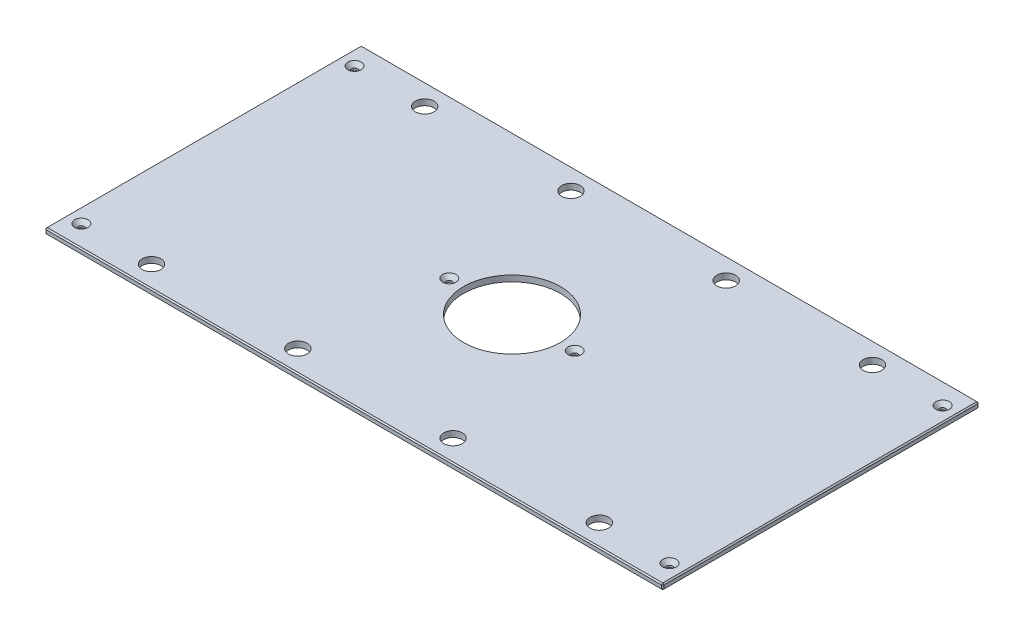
ISO-10303-21;
HEADER;
FILE_DESCRIPTION(('STEP AP214'),'2;1');
FILE_NAME('part.step','',(''),(''),'','','');
FILE_SCHEMA(('AUTOMOTIVE_DESIGN { 1 0 10303 214 1 1 1 1 }'));
ENDSEC;
DATA;
#1=APPLICATION_CONTEXT('core data for automotive mechanical design processes');
#2=APPLICATION_PROTOCOL_DEFINITION('international standard','automotive_design',2000,#1);
#3=PRODUCT_CONTEXT('',#1,'mechanical');
#4=PRODUCT('Part','Part','',(#3));
#5=PRODUCT_RELATED_PRODUCT_CATEGORY('part','',(#4));
#6=PRODUCT_DEFINITION_FORMATION('','',#4);
#7=PRODUCT_DEFINITION_CONTEXT('part definition',#1,'design');
#8=PRODUCT_DEFINITION('design','',#6,#7);
#9=PRODUCT_DEFINITION_SHAPE('','',#8);
#10=(LENGTH_UNIT() NAMED_UNIT(*) SI_UNIT(.MILLI.,.METRE.));
#11=(NAMED_UNIT(*) PLANE_ANGLE_UNIT() SI_UNIT($,.RADIAN.));
#12=(NAMED_UNIT(*) SI_UNIT($,.STERADIAN.) SOLID_ANGLE_UNIT());
#13=UNCERTAINTY_MEASURE_WITH_UNIT(LENGTH_MEASURE(1.E-05),#10,'distance_accuracy_value','');
#14=(GEOMETRIC_REPRESENTATION_CONTEXT(3) GLOBAL_UNCERTAINTY_ASSIGNED_CONTEXT((#13)) GLOBAL_UNIT_ASSIGNED_CONTEXT((#10,
#11,#12)) REPRESENTATION_CONTEXT('',''));
#15=CARTESIAN_POINT('',(0.,0.,0.));
#16=DIRECTION('',(0.,0.,1.));
#17=DIRECTION('',(1.,0.,0.));
#18=AXIS2_PLACEMENT_3D('',#15,#16,#17);
#19=CARTESIAN_POINT('',(-328.6125,6.35,-168.275));
#20=DIRECTION('',(1.,0.,0.));
#21=DIRECTION('',(0.,0.,-1.));
#22=AXIS2_PLACEMENT_3D('',#19,#20,#21);
#23=PLANE('',#22);
#24=DIRECTION('',(0.,0.,-1.));
#25=VECTOR('',#24,1.);
#26=CARTESIAN_POINT('',(-328.6125,5.08000000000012,-168.275));
#27=LINE('',#26,#25);
#28=CARTESIAN_POINT('',(-328.6125,5.08000000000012,167.005));
#29=VERTEX_POINT('',#28);
#30=CARTESIAN_POINT('',(-328.6125,5.08000000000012,-167.005));
#31=VERTEX_POINT('',#30);
#32=EDGE_CURVE('E140',#29,#31,#27,.T.);
#33=ORIENTED_EDGE('',*,*,#32,.T.);
#34=DIRECTION('',(0.,-1.,0.));
#35=VECTOR('',#34,1.);
#36=CARTESIAN_POINT('',(-328.6125,6.35,-167.005));
#37=LINE('',#36,#35);
#38=CARTESIAN_POINT('',(-328.6125,1.26999999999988,-167.005));
#39=VERTEX_POINT('',#38);
#40=EDGE_CURVE('E135',#31,#39,#37,.T.);
#41=ORIENTED_EDGE('',*,*,#40,.T.);
#42=DIRECTION('',(0.,0.,1.));
#43=VECTOR('',#42,1.);
#44=CARTESIAN_POINT('',(-328.6125,1.26999999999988,-168.275));
#45=LINE('',#44,#43);
#46=CARTESIAN_POINT('',(-328.6125,1.26999999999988,167.005));
#47=VERTEX_POINT('',#46);
#48=EDGE_CURVE('E130',#39,#47,#45,.T.);
#49=ORIENTED_EDGE('',*,*,#48,.T.);
#50=DIRECTION('',(0.,1.,0.));
#51=VECTOR('',#50,1.);
#52=CARTESIAN_POINT('',(-328.6125,6.35,167.005));
#53=LINE('',#52,#51);
#54=EDGE_CURVE('E132',#47,#29,#53,.T.);
#55=ORIENTED_EDGE('',*,*,#54,.T.);
#56=EDGE_LOOP('',(#33,#41,#49,#55));
#57=FACE_BOUND('',#56,.T.);
#58=ADVANCED_FACE('F38',(#57),#23,.F.);
#59=CARTESIAN_POINT('',(-328.6125,6.35,168.275));
#60=DIRECTION('',(0.,0.,-1.));
#61=DIRECTION('',(-1.,0.,0.));
#62=AXIS2_PLACEMENT_3D('',#59,#60,#61);
#63=PLANE('',#62);
#64=DIRECTION('',(1.,0.,0.));
#65=VECTOR('',#64,1.);
#66=CARTESIAN_POINT('',(-328.6125,1.26999999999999,168.275));
#67=LINE('',#66,#65);
#68=CARTESIAN_POINT('',(-327.3425,1.26999999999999,168.275));
#69=VERTEX_POINT('',#68);
#70=CARTESIAN_POINT('',(327.3425,1.26999999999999,168.275));
#71=VERTEX_POINT('',#70);
#72=EDGE_CURVE('E62',#69,#71,#67,.T.);
#73=ORIENTED_EDGE('',*,*,#72,.T.);
#74=DIRECTION('',(0.,1.,0.));
#75=VECTOR('',#74,1.);
#76=CARTESIAN_POINT('',(327.3425,6.35,168.275));
#77=LINE('',#76,#75);
#78=CARTESIAN_POINT('',(327.3425,5.08000000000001,168.275));
#79=VERTEX_POINT('',#78);
#80=EDGE_CURVE('E11',#71,#79,#77,.T.);
#81=ORIENTED_EDGE('',*,*,#80,.T.);
#82=DIRECTION('',(-1.,0.,0.));
#83=VECTOR('',#82,1.);
#84=CARTESIAN_POINT('',(-328.6125,5.08000000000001,168.275));
#85=LINE('',#84,#83);
#86=CARTESIAN_POINT('',(-327.3425,5.08000000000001,168.275));
#87=VERTEX_POINT('',#86);
#88=EDGE_CURVE('E48',#79,#87,#85,.T.);
#89=ORIENTED_EDGE('',*,*,#88,.T.);
#90=DIRECTION('',(0.,-1.,0.));
#91=VECTOR('',#90,1.);
#92=CARTESIAN_POINT('',(-327.3425,6.35,168.275));
#93=LINE('',#92,#91);
#94=EDGE_CURVE('E367',#87,#69,#93,.T.);
#95=ORIENTED_EDGE('',*,*,#94,.T.);
#96=EDGE_LOOP('',(#73,#81,#89,#95));
#97=FACE_BOUND('',#96,.T.);
#98=ADVANCED_FACE('F445',(#97),#63,.F.);
#99=CARTESIAN_POINT('',(328.6125,6.35,-168.275));
#100=DIRECTION('',(-1.,0.,0.));
#101=DIRECTION('',(0.,0.,1.));
#102=AXIS2_PLACEMENT_3D('',#99,#100,#101);
#103=PLANE('',#102);
#104=DIRECTION('',(0.,0.,-1.));
#105=VECTOR('',#104,1.);
#106=CARTESIAN_POINT('',(328.6125,1.26999999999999,-168.275));
#107=LINE('',#106,#105);
#108=CARTESIAN_POINT('',(328.6125,1.26999999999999,167.005));
#109=VERTEX_POINT('',#108);
#110=CARTESIAN_POINT('',(328.6125,1.26999999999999,-167.005));
#111=VERTEX_POINT('',#110);
#112=EDGE_CURVE('E360',#109,#111,#107,.T.);
#113=ORIENTED_EDGE('',*,*,#112,.T.);
#114=DIRECTION('',(0.,1.,0.));
#115=VECTOR('',#114,1.);
#116=CARTESIAN_POINT('',(328.6125,6.35,-167.005));
#117=LINE('',#116,#115);
#118=CARTESIAN_POINT('',(328.6125,5.08000000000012,-167.005));
#119=VERTEX_POINT('',#118);
#120=EDGE_CURVE('E363',#111,#119,#117,.T.);
#121=ORIENTED_EDGE('',*,*,#120,.T.);
#122=DIRECTION('',(0.,0.,1.));
#123=VECTOR('',#122,1.);
#124=CARTESIAN_POINT('',(328.6125,5.08000000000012,168.275));
#125=LINE('',#124,#123);
#126=CARTESIAN_POINT('',(328.6125,5.08000000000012,167.005));
#127=VERTEX_POINT('',#126);
#128=EDGE_CURVE('E357',#119,#127,#125,.T.);
#129=ORIENTED_EDGE('',*,*,#128,.T.);
#130=DIRECTION('',(0.,-1.,0.));
#131=VECTOR('',#130,1.);
#132=CARTESIAN_POINT('',(328.6125,6.35,167.005));
#133=LINE('',#132,#131);
#134=EDGE_CURVE('E354',#127,#109,#133,.T.);
#135=ORIENTED_EDGE('',*,*,#134,.T.);
#136=EDGE_LOOP('',(#113,#121,#129,#135));
#137=FACE_BOUND('',#136,.T.);
#138=ADVANCED_FACE('F432',(#137),#103,.F.);
#139=CARTESIAN_POINT('',(-328.6125,6.35,-168.275));
#140=DIRECTION('',(0.,0.,1.));
#141=DIRECTION('',(1.,0.,0.));
#142=AXIS2_PLACEMENT_3D('',#139,#140,#141);
#143=PLANE('',#142);
#144=DIRECTION('',(-1.,0.,0.));
#145=VECTOR('',#144,1.);
#146=CARTESIAN_POINT('',(-328.6125,1.26999999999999,-168.275));
#147=LINE('',#146,#145);
#148=CARTESIAN_POINT('',(327.3425,1.26999999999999,-168.275));
#149=VERTEX_POINT('',#148);
#150=CARTESIAN_POINT('',(-327.3425,1.26999999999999,-168.275));
#151=VERTEX_POINT('',#150);
#152=EDGE_CURVE('E320',#149,#151,#147,.T.);
#153=ORIENTED_EDGE('',*,*,#152,.T.);
#154=DIRECTION('',(0.,1.,0.));
#155=VECTOR('',#154,1.);
#156=CARTESIAN_POINT('',(-327.3425,6.35,-168.275));
#157=LINE('',#156,#155);
#158=CARTESIAN_POINT('',(-327.3425,5.08000000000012,-168.275));
#159=VERTEX_POINT('',#158);
#160=EDGE_CURVE('E326',#151,#159,#157,.T.);
#161=ORIENTED_EDGE('',*,*,#160,.T.);
#162=DIRECTION('',(1.,0.,0.));
#163=VECTOR('',#162,1.);
#164=CARTESIAN_POINT('',(328.6125,5.08000000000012,-168.275));
#165=LINE('',#164,#163);
#166=CARTESIAN_POINT('',(327.3425,5.08000000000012,-168.275));
#167=VERTEX_POINT('',#166);
#168=EDGE_CURVE('E323',#159,#167,#165,.T.);
#169=ORIENTED_EDGE('',*,*,#168,.T.);
#170=DIRECTION('',(0.,-1.,0.));
#171=VECTOR('',#170,1.);
#172=CARTESIAN_POINT('',(327.3425,6.35,-168.275));
#173=LINE('',#172,#171);
#174=EDGE_CURVE('E317',#167,#149,#173,.T.);
#175=ORIENTED_EDGE('',*,*,#174,.T.);
#176=EDGE_LOOP('',(#153,#161,#169,#175));
#177=FACE_BOUND('',#176,.T.);
#178=ADVANCED_FACE('F406',(#177),#143,.F.);
#179=CARTESIAN_POINT('',(0.,6.35,0.));
#180=DIRECTION('',(0.,1.,0.));
#181=DIRECTION('',(0.,0.,1.));
#182=AXIS2_PLACEMENT_3D('',#179,#180,#181);
#183=PLANE('',#182);
#184=CARTESIAN_POINT('',(312.7375,6.35,-145.25498));
#185=DIRECTION('',(0.,1.,0.));
#186=DIRECTION('',(0.,0.,1.));
#187=AXIS2_PLACEMENT_3D('',#184,#185,#186);
#188=CIRCLE('',#187,7.13740000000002);
#189=CARTESIAN_POINT('',(312.7375,6.35,-138.11758));
#190=VERTEX_POINT('',#189);
#191=EDGE_CURVE('E977',#190,#190,#188,.T.);
#192=ORIENTED_EDGE('',*,*,#191,.F.);
#193=EDGE_LOOP('',(#192));
#194=FACE_BOUND('',#193,.T.);
#195=CARTESIAN_POINT('',(312.7375,6.35,145.25498));
#196=DIRECTION('',(0.,1.,0.));
#197=DIRECTION('',(0.,0.,1.));
#198=AXIS2_PLACEMENT_3D('',#195,#196,#197);
#199=CIRCLE('',#198,7.13740000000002);
#200=CARTESIAN_POINT('',(312.7375,6.35,152.39238));
#201=VERTEX_POINT('',#200);
#202=EDGE_CURVE('E981',#201,#201,#199,.T.);
#203=ORIENTED_EDGE('',*,*,#202,.F.);
#204=EDGE_LOOP('',(#203));
#205=FACE_BOUND('',#204,.T.);
#206=CARTESIAN_POINT('',(-312.7375,6.35,145.25498));
#207=DIRECTION('',(0.,1.,0.));
#208=DIRECTION('',(0.,0.,1.));
#209=AXIS2_PLACEMENT_3D('',#206,#207,#208);
#210=CIRCLE('',#209,7.13740000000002);
#211=CARTESIAN_POINT('',(-312.7375,6.35,152.39238));
#212=VERTEX_POINT('',#211);
#213=EDGE_CURVE('E985',#212,#212,#210,.T.);
#214=ORIENTED_EDGE('',*,*,#213,.F.);
#215=EDGE_LOOP('',(#214));
#216=FACE_BOUND('',#215,.T.);
#217=CARTESIAN_POINT('',(-66.675,6.35,0.));
#218=DIRECTION('',(0.,1.,0.));
#219=DIRECTION('',(0.,0.,1.));
#220=AXIS2_PLACEMENT_3D('',#217,#218,#219);
#221=CIRCLE('',#220,7.1374);
#222=CARTESIAN_POINT('',(-66.675,6.35,7.1374));
#223=VERTEX_POINT('',#222);
#224=EDGE_CURVE('E989',#223,#223,#221,.T.);
#225=ORIENTED_EDGE('',*,*,#224,.F.);
#226=EDGE_LOOP('',(#225));
#227=FACE_BOUND('',#226,.T.);
#228=CARTESIAN_POINT('',(66.675,6.35,0.));
#229=DIRECTION('',(0.,1.,0.));
#230=DIRECTION('',(0.,0.,1.));
#231=AXIS2_PLACEMENT_3D('',#228,#229,#230);
#232=CIRCLE('',#231,7.1374);
#233=CARTESIAN_POINT('',(66.675,6.35,7.1374));
#234=VERTEX_POINT('',#233);
#235=EDGE_CURVE('E993',#234,#234,#232,.T.);
#236=ORIENTED_EDGE('',*,*,#235,.F.);
#237=EDGE_LOOP('',(#236));
#238=FACE_BOUND('',#237,.T.);
#239=CARTESIAN_POINT('',(-312.7375,6.35,-145.25498));
#240=DIRECTION('',(0.,1.,0.));
#241=DIRECTION('',(0.,0.,1.));
#242=AXIS2_PLACEMENT_3D('',#239,#240,#241);
#243=CIRCLE('',#242,7.13740000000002);
#244=CARTESIAN_POINT('',(-312.7375,6.35,-138.11758));
#245=VERTEX_POINT('',#244);
#246=EDGE_CURVE('E996',#245,#245,#243,.T.);
#247=ORIENTED_EDGE('',*,*,#246,.F.);
#248=EDGE_LOOP('',(#247));
#249=FACE_BOUND('',#248,.T.);
#250=DIRECTION('',(0.,0.,-1.));
#251=VECTOR('',#250,1.);
#252=CARTESIAN_POINT('',(327.3425,6.35,-168.275));
#253=LINE('',#252,#251);
#254=CARTESIAN_POINT('',(327.3425,6.35,167.005));
#255=VERTEX_POINT('',#254);
#256=CARTESIAN_POINT('',(327.3425,6.35,-167.005));
#257=VERTEX_POINT('',#256);
#258=EDGE_CURVE('E336',#255,#257,#253,.T.);
#259=ORIENTED_EDGE('',*,*,#258,.T.);
#260=DIRECTION('',(-1.,0.,0.));
#261=VECTOR('',#260,1.);
#262=CARTESIAN_POINT('',(-328.6125,6.35,-167.005));
#263=LINE('',#262,#261);
#264=CARTESIAN_POINT('',(-327.3425,6.35,-167.005));
#265=VERTEX_POINT('',#264);
#266=EDGE_CURVE('E339',#257,#265,#263,.T.);
#267=ORIENTED_EDGE('',*,*,#266,.T.);
#268=DIRECTION('',(0.,0.,1.));
#269=VECTOR('',#268,1.);
#270=CARTESIAN_POINT('',(-327.3425,6.35,168.275));
#271=LINE('',#270,#269);
#272=CARTESIAN_POINT('',(-327.3425,6.35,167.005));
#273=VERTEX_POINT('',#272);
#274=EDGE_CURVE('E333',#265,#273,#271,.T.);
#275=ORIENTED_EDGE('',*,*,#274,.T.);
#276=DIRECTION('',(1.,0.,0.));
#277=VECTOR('',#276,1.);
#278=CARTESIAN_POINT('',(328.6125,6.35,167.005));
#279=LINE('',#278,#277);
#280=EDGE_CURVE('E330',#273,#255,#279,.T.);
#281=ORIENTED_EDGE('',*,*,#280,.T.);
#282=EDGE_LOOP('',(#259,#267,#275,#281));
#283=FACE_BOUND('',#282,.T.);
#284=CARTESIAN_POINT('',(238.125,6.35,-145.25498));
#285=DIRECTION('',(0.,1.,0.));
#286=DIRECTION('',(0.,0.,1.));
#287=AXIS2_PLACEMENT_3D('',#284,#285,#286);
#288=CIRCLE('',#287,9.921875);
#289=CARTESIAN_POINT('',(238.125,6.35,-135.333105));
#290=VERTEX_POINT('',#289);
#291=EDGE_CURVE('E231',#290,#290,#288,.T.);
#292=ORIENTED_EDGE('',*,*,#291,.F.);
#293=EDGE_LOOP('',(#292));
#294=FACE_BOUND('',#293,.T.);
#295=CARTESIAN_POINT('',(-238.125,6.35,-145.25498));
#296=DIRECTION('',(0.,1.,0.));
#297=DIRECTION('',(0.,0.,1.));
#298=AXIS2_PLACEMENT_3D('',#295,#296,#297);
#299=CIRCLE('',#298,9.921875);
#300=CARTESIAN_POINT('',(-238.125,6.35,-135.333105));
#301=VERTEX_POINT('',#300);
#302=EDGE_CURVE('E246',#301,#301,#299,.T.);
#303=ORIENTED_EDGE('',*,*,#302,.F.);
#304=EDGE_LOOP('',(#303));
#305=FACE_BOUND('',#304,.T.);
#306=CARTESIAN_POINT('',(238.125,6.35,145.25498));
#307=DIRECTION('',(0.,1.,0.));
#308=DIRECTION('',(0.,0.,1.));
#309=AXIS2_PLACEMENT_3D('',#306,#307,#308);
#310=CIRCLE('',#309,9.921875);
#311=CARTESIAN_POINT('',(238.125,6.35,155.176855));
#312=VERTEX_POINT('',#311);
#313=EDGE_CURVE('E259',#312,#312,#310,.T.);
#314=ORIENTED_EDGE('',*,*,#313,.F.);
#315=EDGE_LOOP('',(#314));
#316=FACE_BOUND('',#315,.T.);
#317=CARTESIAN_POINT('',(-238.125,6.35,145.25498));
#318=DIRECTION('',(0.,1.,0.));
#319=DIRECTION('',(0.,0.,1.));
#320=AXIS2_PLACEMENT_3D('',#317,#318,#319);
#321=CIRCLE('',#320,9.921875);
#322=CARTESIAN_POINT('',(-238.125,6.35,155.176855));
#323=VERTEX_POINT('',#322);
#324=EDGE_CURVE('E267',#323,#323,#321,.T.);
#325=ORIENTED_EDGE('',*,*,#324,.F.);
#326=EDGE_LOOP('',(#325));
#327=FACE_BOUND('',#326,.T.);
#328=CARTESIAN_POINT('',(-82.55,6.35,-145.25498));
#329=DIRECTION('',(0.,1.,0.));
#330=DIRECTION('',(0.,0.,1.));
#331=AXIS2_PLACEMENT_3D('',#328,#329,#330);
#332=CIRCLE('',#331,9.921875);
#333=CARTESIAN_POINT('',(-82.55,6.35,-135.333105));
#334=VERTEX_POINT('',#333);
#335=EDGE_CURVE('E274',#334,#334,#332,.T.);
#336=ORIENTED_EDGE('',*,*,#335,.F.);
#337=EDGE_LOOP('',(#336));
#338=FACE_BOUND('',#337,.T.);
#339=CARTESIAN_POINT('',(82.55,6.35,-145.25498));
#340=DIRECTION('',(0.,1.,0.));
#341=DIRECTION('',(0.,0.,1.));
#342=AXIS2_PLACEMENT_3D('',#339,#340,#341);
#343=CIRCLE('',#342,9.921875);
#344=CARTESIAN_POINT('',(82.55,6.35,-135.333105));
#345=VERTEX_POINT('',#344);
#346=EDGE_CURVE('E282',#345,#345,#343,.T.);
#347=ORIENTED_EDGE('',*,*,#346,.F.);
#348=EDGE_LOOP('',(#347));
#349=FACE_BOUND('',#348,.T.);
#350=CARTESIAN_POINT('',(82.55,6.35,145.25498));
#351=DIRECTION('',(0.,1.,0.));
#352=DIRECTION('',(0.,0.,1.));
#353=AXIS2_PLACEMENT_3D('',#350,#351,#352);
#354=CIRCLE('',#353,9.921875);
#355=CARTESIAN_POINT('',(82.55,6.35,155.176855));
#356=VERTEX_POINT('',#355);
#357=EDGE_CURVE('E290',#356,#356,#354,.T.);
#358=ORIENTED_EDGE('',*,*,#357,.F.);
#359=EDGE_LOOP('',(#358));
#360=FACE_BOUND('',#359,.T.);
#361=CARTESIAN_POINT('',(-82.55,6.35,145.25498));
#362=DIRECTION('',(0.,1.,0.));
#363=DIRECTION('',(0.,0.,1.));
#364=AXIS2_PLACEMENT_3D('',#361,#362,#363);
#365=CIRCLE('',#364,9.921875);
#366=CARTESIAN_POINT('',(-82.55,6.35,155.176855));
#367=VERTEX_POINT('',#366);
#368=EDGE_CURVE('E298',#367,#367,#365,.T.);
#369=ORIENTED_EDGE('',*,*,#368,.F.);
#370=EDGE_LOOP('',(#369));
#371=FACE_BOUND('',#370,.T.);
#372=CARTESIAN_POINT('',(0.,6.35,0.));
#373=DIRECTION('',(0.,1.,0.));
#374=DIRECTION('',(0.,0.,1.));
#375=AXIS2_PLACEMENT_3D('',#372,#373,#374);
#376=CIRCLE('',#375,51.562);
#377=CARTESIAN_POINT('',(0.,6.35,51.562));
#378=VERTEX_POINT('',#377);
#379=EDGE_CURVE('E306',#378,#378,#376,.T.);
#380=ORIENTED_EDGE('',*,*,#379,.F.);
#381=EDGE_LOOP('',(#380));
#382=FACE_BOUND('',#381,.T.);
#383=ADVANCED_FACE('F454',(#194,#205,#216,#227,#238,#249,#283,#294,#305,#316,#327,#338,#349,
#360,#371,#382),#183,.T.);
#384=CARTESIAN_POINT('',(0.,0.,0.));
#385=DIRECTION('',(0.,1.,0.));
#386=DIRECTION('',(0.,0.,1.));
#387=AXIS2_PLACEMENT_3D('',#384,#385,#386);
#388=PLANE('',#387);
#389=CARTESIAN_POINT('',(312.7375,0.,-145.25498));
#390=DIRECTION('',(0.,1.,0.));
#391=DIRECTION('',(0.,0.,1.));
#392=AXIS2_PLACEMENT_3D('',#389,#390,#391);
#393=CIRCLE('',#392,3.3782);
#394=CARTESIAN_POINT('',(312.7375,0.,-141.87678));
#395=VERTEX_POINT('',#394);
#396=EDGE_CURVE('E1041',#395,#395,#393,.T.);
#397=ORIENTED_EDGE('',*,*,#396,.T.);
#398=EDGE_LOOP('',(#397));
#399=FACE_BOUND('',#398,.T.);
#400=CARTESIAN_POINT('',(312.7375,0.,145.25498));
#401=DIRECTION('',(0.,1.,0.));
#402=DIRECTION('',(0.,0.,1.));
#403=AXIS2_PLACEMENT_3D('',#400,#401,#402);
#404=CIRCLE('',#403,3.3782);
#405=CARTESIAN_POINT('',(312.7375,0.,148.63318));
#406=VERTEX_POINT('',#405);
#407=EDGE_CURVE('E1032',#406,#406,#404,.T.);
#408=ORIENTED_EDGE('',*,*,#407,.T.);
#409=EDGE_LOOP('',(#408));
#410=FACE_BOUND('',#409,.T.);
#411=CARTESIAN_POINT('',(-312.7375,0.,145.25498));
#412=DIRECTION('',(0.,1.,0.));
#413=DIRECTION('',(0.,0.,1.));
#414=AXIS2_PLACEMENT_3D('',#411,#412,#413);
#415=CIRCLE('',#414,3.3782);
#416=CARTESIAN_POINT('',(-312.7375,0.,148.63318));
#417=VERTEX_POINT('',#416);
#418=EDGE_CURVE('E1023',#417,#417,#415,.T.);
#419=ORIENTED_EDGE('',*,*,#418,.T.);
#420=EDGE_LOOP('',(#419));
#421=FACE_BOUND('',#420,.T.);
#422=CARTESIAN_POINT('',(-66.675,0.,0.));
#423=DIRECTION('',(0.,1.,0.));
#424=DIRECTION('',(0.,0.,1.));
#425=AXIS2_PLACEMENT_3D('',#422,#423,#424);
#426=CIRCLE('',#425,3.3782);
#427=CARTESIAN_POINT('',(-66.675,0.,3.3782));
#428=VERTEX_POINT('',#427);
#429=EDGE_CURVE('E1015',#428,#428,#426,.T.);
#430=ORIENTED_EDGE('',*,*,#429,.T.);
#431=EDGE_LOOP('',(#430));
#432=FACE_BOUND('',#431,.T.);
#433=CARTESIAN_POINT('',(66.675,0.,0.));
#434=DIRECTION('',(0.,1.,0.));
#435=DIRECTION('',(0.,0.,1.));
#436=AXIS2_PLACEMENT_3D('',#433,#434,#435);
#437=CIRCLE('',#436,3.3782);
#438=CARTESIAN_POINT('',(66.675,0.,3.3782));
#439=VERTEX_POINT('',#438);
#440=EDGE_CURVE('E1000',#439,#439,#437,.T.);
#441=ORIENTED_EDGE('',*,*,#440,.T.);
#442=EDGE_LOOP('',(#441));
#443=FACE_BOUND('',#442,.T.);
#444=CARTESIAN_POINT('',(-312.7375,0.,-145.25498));
#445=DIRECTION('',(0.,1.,0.));
#446=DIRECTION('',(0.,0.,1.));
#447=AXIS2_PLACEMENT_3D('',#444,#445,#446);
#448=CIRCLE('',#447,3.3782);
#449=CARTESIAN_POINT('',(-312.7375,0.,-141.87678));
#450=VERTEX_POINT('',#449);
#451=EDGE_CURVE('E249',#450,#450,#448,.T.);
#452=ORIENTED_EDGE('',*,*,#451,.T.);
#453=EDGE_LOOP('',(#452));
#454=FACE_BOUND('',#453,.T.);
#455=DIRECTION('',(0.,0.,-1.));
#456=VECTOR('',#455,1.);
#457=CARTESIAN_POINT('',(-327.3425,0.,0.));
#458=LINE('',#457,#456);
#459=CARTESIAN_POINT('',(-327.3425,0.,167.005));
#460=VERTEX_POINT('',#459);
#461=CARTESIAN_POINT('',(-327.3425,0.,-167.005));
#462=VERTEX_POINT('',#461);
#463=EDGE_CURVE('E165',#460,#462,#458,.T.);
#464=ORIENTED_EDGE('',*,*,#463,.T.);
#465=DIRECTION('',(1.,0.,0.));
#466=VECTOR('',#465,1.);
#467=CARTESIAN_POINT('',(0.,0.,-167.005));
#468=LINE('',#467,#466);
#469=CARTESIAN_POINT('',(327.3425,0.,-167.005));
#470=VERTEX_POINT('',#469);
#471=EDGE_CURVE('E350',#462,#470,#468,.T.);
#472=ORIENTED_EDGE('',*,*,#471,.T.);
#473=DIRECTION('',(0.,0.,1.));
#474=VECTOR('',#473,1.);
#475=CARTESIAN_POINT('',(327.3425,0.,0.));
#476=LINE('',#475,#474);
#477=CARTESIAN_POINT('',(327.3425,0.,167.005));
#478=VERTEX_POINT('',#477);
#479=EDGE_CURVE('E347',#470,#478,#476,.T.);
#480=ORIENTED_EDGE('',*,*,#479,.T.);
#481=DIRECTION('',(-1.,0.,0.));
#482=VECTOR('',#481,1.);
#483=CARTESIAN_POINT('',(0.,0.,167.005));
#484=LINE('',#483,#482);
#485=EDGE_CURVE('E343',#478,#460,#484,.T.);
#486=ORIENTED_EDGE('',*,*,#485,.T.);
#487=EDGE_LOOP('',(#464,#472,#480,#486));
#488=FACE_BOUND('',#487,.T.);
#489=CARTESIAN_POINT('',(238.125,0.,-145.25498));
#490=DIRECTION('',(0.,1.,0.));
#491=DIRECTION('',(0.,0.,1.));
#492=AXIS2_PLACEMENT_3D('',#489,#490,#491);
#493=CIRCLE('',#492,9.921875);
#494=CARTESIAN_POINT('',(238.125,0.,-135.333105));
#495=VERTEX_POINT('',#494);
#496=EDGE_CURVE('E238',#495,#495,#493,.T.);
#497=ORIENTED_EDGE('',*,*,#496,.T.);
#498=EDGE_LOOP('',(#497));
#499=FACE_BOUND('',#498,.T.);
#500=CARTESIAN_POINT('',(-238.125,0.,-145.25498));
#501=DIRECTION('',(0.,1.,0.));
#502=DIRECTION('',(0.,0.,1.));
#503=AXIS2_PLACEMENT_3D('',#500,#501,#502);
#504=CIRCLE('',#503,9.921875);
#505=CARTESIAN_POINT('',(-238.125,0.,-135.333105));
#506=VERTEX_POINT('',#505);
#507=EDGE_CURVE('E255',#506,#506,#504,.T.);
#508=ORIENTED_EDGE('',*,*,#507,.T.);
#509=EDGE_LOOP('',(#508));
#510=FACE_BOUND('',#509,.T.);
#511=CARTESIAN_POINT('',(238.125,0.,145.25498));
#512=DIRECTION('',(0.,1.,0.));
#513=DIRECTION('',(0.,0.,1.));
#514=AXIS2_PLACEMENT_3D('',#511,#512,#513);
#515=CIRCLE('',#514,9.921875);
#516=CARTESIAN_POINT('',(238.125,0.,155.176855));
#517=VERTEX_POINT('',#516);
#518=EDGE_CURVE('E263',#517,#517,#515,.T.);
#519=ORIENTED_EDGE('',*,*,#518,.T.);
#520=EDGE_LOOP('',(#519));
#521=FACE_BOUND('',#520,.T.);
#522=CARTESIAN_POINT('',(-238.125,0.,145.25498));
#523=DIRECTION('',(0.,1.,0.));
#524=DIRECTION('',(0.,0.,1.));
#525=AXIS2_PLACEMENT_3D('',#522,#523,#524);
#526=CIRCLE('',#525,9.921875);
#527=CARTESIAN_POINT('',(-238.125,0.,155.176855));
#528=VERTEX_POINT('',#527);
#529=EDGE_CURVE('E270',#528,#528,#526,.T.);
#530=ORIENTED_EDGE('',*,*,#529,.T.);
#531=EDGE_LOOP('',(#530));
#532=FACE_BOUND('',#531,.T.);
#533=CARTESIAN_POINT('',(-82.55,0.,-145.25498));
#534=DIRECTION('',(0.,1.,0.));
#535=DIRECTION('',(0.,0.,1.));
#536=AXIS2_PLACEMENT_3D('',#533,#534,#535);
#537=CIRCLE('',#536,9.921875);
#538=CARTESIAN_POINT('',(-82.55,0.,-135.333105));
#539=VERTEX_POINT('',#538);
#540=EDGE_CURVE('E278',#539,#539,#537,.T.);
#541=ORIENTED_EDGE('',*,*,#540,.T.);
#542=EDGE_LOOP('',(#541));
#543=FACE_BOUND('',#542,.T.);
#544=CARTESIAN_POINT('',(82.55,0.,-145.25498));
#545=DIRECTION('',(0.,1.,0.));
#546=DIRECTION('',(0.,0.,1.));
#547=AXIS2_PLACEMENT_3D('',#544,#545,#546);
#548=CIRCLE('',#547,9.921875);
#549=CARTESIAN_POINT('',(82.55,0.,-135.333105));
#550=VERTEX_POINT('',#549);
#551=EDGE_CURVE('E286',#550,#550,#548,.T.);
#552=ORIENTED_EDGE('',*,*,#551,.T.);
#553=EDGE_LOOP('',(#552));
#554=FACE_BOUND('',#553,.T.);
#555=CARTESIAN_POINT('',(82.55,0.,145.25498));
#556=DIRECTION('',(0.,1.,0.));
#557=DIRECTION('',(0.,0.,1.));
#558=AXIS2_PLACEMENT_3D('',#555,#556,#557);
#559=CIRCLE('',#558,9.921875);
#560=CARTESIAN_POINT('',(82.55,0.,155.176855));
#561=VERTEX_POINT('',#560);
#562=EDGE_CURVE('E294',#561,#561,#559,.T.);
#563=ORIENTED_EDGE('',*,*,#562,.T.);
#564=EDGE_LOOP('',(#563));
#565=FACE_BOUND('',#564,.T.);
#566=CARTESIAN_POINT('',(-82.55,0.,145.25498));
#567=DIRECTION('',(0.,1.,0.));
#568=DIRECTION('',(0.,0.,1.));
#569=AXIS2_PLACEMENT_3D('',#566,#567,#568);
#570=CIRCLE('',#569,9.921875);
#571=CARTESIAN_POINT('',(-82.55,0.,155.176855));
#572=VERTEX_POINT('',#571);
#573=EDGE_CURVE('E302',#572,#572,#570,.T.);
#574=ORIENTED_EDGE('',*,*,#573,.T.);
#575=EDGE_LOOP('',(#574));
#576=FACE_BOUND('',#575,.T.);
#577=CARTESIAN_POINT('',(0.,0.,0.));
#578=DIRECTION('',(0.,1.,0.));
#579=DIRECTION('',(0.,0.,1.));
#580=AXIS2_PLACEMENT_3D('',#577,#578,#579);
#581=CIRCLE('',#580,51.562);
#582=CARTESIAN_POINT('',(0.,0.,51.562));
#583=VERTEX_POINT('',#582);
#584=EDGE_CURVE('E153',#583,#583,#581,.T.);
#585=ORIENTED_EDGE('',*,*,#584,.T.);
#586=EDGE_LOOP('',(#585));
#587=FACE_BOUND('',#586,.T.);
#588=ADVANCED_FACE('F419',(#399,#410,#421,#432,#443,#454,#488,#499,#510,#521,#532,#543,#554,
#565,#576,#587),#388,.F.);
#589=CARTESIAN_POINT('',(0.,0.,0.));
#590=DIRECTION('',(0.,1.,0.));
#591=DIRECTION('',(0.,0.,1.));
#592=AXIS2_PLACEMENT_3D('',#589,#590,#591);
#593=CYLINDRICAL_SURFACE('',#592,51.562);
#594=ORIENTED_EDGE('',*,*,#584,.F.);
#595=EDGE_LOOP('',(#594));
#596=FACE_BOUND('',#595,.T.);
#597=ORIENTED_EDGE('',*,*,#379,.T.);
#598=EDGE_LOOP('',(#597));
#599=FACE_BOUND('',#598,.T.);
#600=ADVANCED_FACE('F700',(#596,#599),#593,.F.);
#601=CARTESIAN_POINT('',(-82.55,6.35,145.25498));
#602=DIRECTION('',(0.,1.,0.));
#603=DIRECTION('',(0.,0.,1.));
#604=AXIS2_PLACEMENT_3D('',#601,#602,#603);
#605=CYLINDRICAL_SURFACE('',#604,9.921875);
#606=ORIENTED_EDGE('',*,*,#573,.F.);
#607=EDGE_LOOP('',(#606));
#608=FACE_BOUND('',#607,.T.);
#609=ORIENTED_EDGE('',*,*,#368,.T.);
#610=EDGE_LOOP('',(#609));
#611=FACE_BOUND('',#610,.T.);
#612=ADVANCED_FACE('F894',(#608,#611),#605,.F.);
#613=CARTESIAN_POINT('',(82.55,6.35,145.25498));
#614=DIRECTION('',(0.,1.,0.));
#615=DIRECTION('',(0.,0.,1.));
#616=AXIS2_PLACEMENT_3D('',#613,#614,#615);
#617=CYLINDRICAL_SURFACE('',#616,9.921875);
#618=ORIENTED_EDGE('',*,*,#562,.F.);
#619=EDGE_LOOP('',(#618));
#620=FACE_BOUND('',#619,.T.);
#621=ORIENTED_EDGE('',*,*,#357,.T.);
#622=EDGE_LOOP('',(#621));
#623=FACE_BOUND('',#622,.T.);
#624=ADVANCED_FACE('F884',(#620,#623),#617,.F.);
#625=CARTESIAN_POINT('',(82.55,6.35,-145.25498));
#626=DIRECTION('',(0.,1.,0.));
#627=DIRECTION('',(0.,0.,1.));
#628=AXIS2_PLACEMENT_3D('',#625,#626,#627);
#629=CYLINDRICAL_SURFACE('',#628,9.921875);
#630=ORIENTED_EDGE('',*,*,#551,.F.);
#631=EDGE_LOOP('',(#630));
#632=FACE_BOUND('',#631,.T.);
#633=ORIENTED_EDGE('',*,*,#346,.T.);
#634=EDGE_LOOP('',(#633));
#635=FACE_BOUND('',#634,.T.);
#636=ADVANCED_FACE('F874',(#632,#635),#629,.F.);
#637=CARTESIAN_POINT('',(-82.55,6.35,-145.25498));
#638=DIRECTION('',(0.,1.,0.));
#639=DIRECTION('',(0.,0.,1.));
#640=AXIS2_PLACEMENT_3D('',#637,#638,#639);
#641=CYLINDRICAL_SURFACE('',#640,9.921875);
#642=ORIENTED_EDGE('',*,*,#540,.F.);
#643=EDGE_LOOP('',(#642));
#644=FACE_BOUND('',#643,.T.);
#645=ORIENTED_EDGE('',*,*,#335,.T.);
#646=EDGE_LOOP('',(#645));
#647=FACE_BOUND('',#646,.T.);
#648=ADVANCED_FACE('F864',(#644,#647),#641,.F.);
#649=CARTESIAN_POINT('',(-238.125,6.35,145.25498));
#650=DIRECTION('',(0.,1.,0.));
#651=DIRECTION('',(0.,0.,1.));
#652=AXIS2_PLACEMENT_3D('',#649,#650,#651);
#653=CYLINDRICAL_SURFACE('',#652,9.921875);
#654=ORIENTED_EDGE('',*,*,#529,.F.);
#655=EDGE_LOOP('',(#654));
#656=FACE_BOUND('',#655,.T.);
#657=ORIENTED_EDGE('',*,*,#324,.T.);
#658=EDGE_LOOP('',(#657));
#659=FACE_BOUND('',#658,.T.);
#660=ADVANCED_FACE('F854',(#656,#659),#653,.F.);
#661=CARTESIAN_POINT('',(238.125,6.35,145.25498));
#662=DIRECTION('',(0.,1.,0.));
#663=DIRECTION('',(0.,0.,1.));
#664=AXIS2_PLACEMENT_3D('',#661,#662,#663);
#665=CYLINDRICAL_SURFACE('',#664,9.921875);
#666=ORIENTED_EDGE('',*,*,#518,.F.);
#667=EDGE_LOOP('',(#666));
#668=FACE_BOUND('',#667,.T.);
#669=ORIENTED_EDGE('',*,*,#313,.T.);
#670=EDGE_LOOP('',(#669));
#671=FACE_BOUND('',#670,.T.);
#672=ADVANCED_FACE('F844',(#668,#671),#665,.F.);
#673=CARTESIAN_POINT('',(-238.125,6.35,-145.25498));
#674=DIRECTION('',(0.,1.,0.));
#675=DIRECTION('',(0.,0.,1.));
#676=AXIS2_PLACEMENT_3D('',#673,#674,#675);
#677=CYLINDRICAL_SURFACE('',#676,9.921875);
#678=ORIENTED_EDGE('',*,*,#507,.F.);
#679=EDGE_LOOP('',(#678));
#680=FACE_BOUND('',#679,.T.);
#681=ORIENTED_EDGE('',*,*,#302,.T.);
#682=EDGE_LOOP('',(#681));
#683=FACE_BOUND('',#682,.T.);
#684=ADVANCED_FACE('F834',(#680,#683),#677,.F.);
#685=CARTESIAN_POINT('',(238.125,6.35,-145.25498));
#686=DIRECTION('',(0.,1.,0.));
#687=DIRECTION('',(0.,0.,1.));
#688=AXIS2_PLACEMENT_3D('',#685,#686,#687);
#689=CYLINDRICAL_SURFACE('',#688,9.921875);
#690=ORIENTED_EDGE('',*,*,#496,.F.);
#691=EDGE_LOOP('',(#690));
#692=FACE_BOUND('',#691,.T.);
#693=ORIENTED_EDGE('',*,*,#291,.T.);
#694=EDGE_LOOP('',(#693));
#695=FACE_BOUND('',#694,.T.);
#696=ADVANCED_FACE('F463',(#692,#695),#689,.F.);
#697=CARTESIAN_POINT('',(328.6125,6.35,167.005));
#698=DIRECTION('',(-0.707106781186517,0.,-0.707106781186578));
#699=DIRECTION('',(0.,-1.,0.));
#700=AXIS2_PLACEMENT_3D('',#697,#698,#699);
#701=PLANE('',#700);
#702=DIRECTION('',(-0.707106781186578,0.,0.707106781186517));
#703=VECTOR('',#702,1.);
#704=CARTESIAN_POINT('',(328.6125,5.08000000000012,167.005));
#705=LINE('',#704,#703);
#706=EDGE_CURVE('E42',#79,#127,#705,.F.);
#707=ORIENTED_EDGE('',*,*,#706,.F.);
#708=ORIENTED_EDGE('',*,*,#80,.F.);
#709=DIRECTION('',(0.707106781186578,0.,-0.707106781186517));
#710=VECTOR('',#709,1.);
#711=CARTESIAN_POINT('',(327.9775,1.26999999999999,167.64));
#712=LINE('',#711,#710);
#713=EDGE_CURVE('E221',#109,#71,#712,.F.);
#714=ORIENTED_EDGE('',*,*,#713,.F.);
#715=ORIENTED_EDGE('',*,*,#134,.F.);
#716=EDGE_LOOP('',(#707,#708,#714,#715));
#717=FACE_BOUND('',#716,.T.);
#718=ADVANCED_FACE('F40',(#717),#701,.F.);
#719=CARTESIAN_POINT('',(328.6125,5.08000000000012,167.005));
#720=DIRECTION('',(0.577350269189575,0.577350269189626,0.577350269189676));
#721=DIRECTION('',(0.,-0.707106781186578,0.707106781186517));
#722=AXIS2_PLACEMENT_3D('',#719,#720,#721);
#723=PLANE('',#722);
#724=DIRECTION('',(0.,-0.707106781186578,0.707106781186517));
#725=VECTOR('',#724,1.);
#726=CARTESIAN_POINT('',(327.3425,5.715,167.64));
#727=LINE('',#726,#725);
#728=EDGE_CURVE('E215',#79,#255,#727,.F.);
#729=ORIENTED_EDGE('',*,*,#728,.F.);
#730=ORIENTED_EDGE('',*,*,#706,.T.);
#731=DIRECTION('',(-0.707106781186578,0.707106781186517,0.));
#732=VECTOR('',#731,1.);
#733=CARTESIAN_POINT('',(328.6125,5.08000000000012,167.005));
#734=LINE('',#733,#732);
#735=EDGE_CURVE('E218',#255,#127,#734,.F.);
#736=ORIENTED_EDGE('',*,*,#735,.F.);
#737=EDGE_LOOP('',(#729,#730,#736));
#738=FACE_BOUND('',#737,.T.);
#739=ADVANCED_FACE('F456',(#738),#723,.T.);
#740=CARTESIAN_POINT('',(327.3425,0.,167.005));
#741=DIRECTION('',(0.577350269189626,-0.577350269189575,0.577350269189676));
#742=DIRECTION('',(0.707106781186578,0.,-0.707106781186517));
#743=AXIS2_PLACEMENT_3D('',#740,#741,#742);
#744=PLANE('',#743);
#745=DIRECTION('',(-0.707106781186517,-0.707106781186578,0.));
#746=VECTOR('',#745,1.);
#747=CARTESIAN_POINT('',(327.3425,0.,167.005));
#748=LINE('',#747,#746);
#749=EDGE_CURVE('E207',#109,#478,#748,.T.);
#750=ORIENTED_EDGE('',*,*,#749,.F.);
#751=ORIENTED_EDGE('',*,*,#713,.T.);
#752=DIRECTION('',(0.,0.707106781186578,0.707106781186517));
#753=VECTOR('',#752,1.);
#754=CARTESIAN_POINT('',(327.3425,0.,167.005));
#755=LINE('',#754,#753);
#756=EDGE_CURVE('E211',#478,#71,#755,.T.);
#757=ORIENTED_EDGE('',*,*,#756,.F.);
#758=EDGE_LOOP('',(#750,#751,#757));
#759=FACE_BOUND('',#758,.T.);
#760=ADVANCED_FACE('F425',(#759),#744,.T.);
#761=CARTESIAN_POINT('',(327.3425,6.35,0.));
#762=DIRECTION('',(0.707106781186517,0.707106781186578,0.));
#763=DIRECTION('',(0.,0.,1.));
#764=AXIS2_PLACEMENT_3D('',#761,#762,#763);
#765=PLANE('',#764);
#766=ORIENTED_EDGE('',*,*,#735,.T.);
#767=ORIENTED_EDGE('',*,*,#128,.F.);
#768=DIRECTION('',(0.707106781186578,-0.707106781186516,0.));
#769=VECTOR('',#768,1.);
#770=CARTESIAN_POINT('',(327.9775,5.71500000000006,-167.005));
#771=LINE('',#770,#769);
#772=EDGE_CURVE('E200',#257,#119,#771,.T.);
#773=ORIENTED_EDGE('',*,*,#772,.F.);
#774=ORIENTED_EDGE('',*,*,#258,.F.);
#775=EDGE_LOOP('',(#766,#767,#773,#774));
#776=FACE_BOUND('',#775,.T.);
#777=ADVANCED_FACE('F442',(#776),#765,.T.);
#778=CARTESIAN_POINT('',(0.,6.35,167.005));
#779=DIRECTION('',(0.,0.707106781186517,0.707106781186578));
#780=DIRECTION('',(-1.,0.,0.));
#781=AXIS2_PLACEMENT_3D('',#778,#779,#780);
#782=PLANE('',#781);
#783=ORIENTED_EDGE('',*,*,#728,.T.);
#784=ORIENTED_EDGE('',*,*,#280,.F.);
#785=DIRECTION('',(0.,0.707106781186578,-0.707106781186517));
#786=VECTOR('',#785,1.);
#787=CARTESIAN_POINT('',(-327.3425,6.35,167.005));
#788=LINE('',#787,#786);
#789=EDGE_CURVE('E196',#87,#273,#788,.T.);
#790=ORIENTED_EDGE('',*,*,#789,.F.);
#791=ORIENTED_EDGE('',*,*,#88,.F.);
#792=EDGE_LOOP('',(#783,#784,#790,#791));
#793=FACE_BOUND('',#792,.T.);
#794=ADVANCED_FACE('F447',(#793),#782,.T.);
#795=CARTESIAN_POINT('',(-327.3425,6.35,168.275));
#796=DIRECTION('',(0.707106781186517,0.,-0.707106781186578));
#797=DIRECTION('',(0.,-1.,0.));
#798=AXIS2_PLACEMENT_3D('',#795,#796,#797);
#799=PLANE('',#798);
#800=DIRECTION('',(0.707106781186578,0.,0.707106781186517));
#801=VECTOR('',#800,1.);
#802=CARTESIAN_POINT('',(-328.6125,1.26999999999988,167.005));
#803=LINE('',#802,#801);
#804=EDGE_CURVE('E147',#69,#47,#803,.F.);
#805=ORIENTED_EDGE('',*,*,#804,.F.);
#806=ORIENTED_EDGE('',*,*,#94,.F.);
#807=DIRECTION('',(-0.707106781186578,0.,-0.707106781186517));
#808=VECTOR('',#807,1.);
#809=CARTESIAN_POINT('',(-327.9775,5.08000000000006,167.64));
#810=LINE('',#809,#808);
#811=EDGE_CURVE('E150',#29,#87,#810,.F.);
#812=ORIENTED_EDGE('',*,*,#811,.F.);
#813=ORIENTED_EDGE('',*,*,#54,.F.);
#814=EDGE_LOOP('',(#805,#806,#812,#813));
#815=FACE_BOUND('',#814,.T.);
#816=ADVANCED_FACE('F145',(#815),#799,.F.);
#817=CARTESIAN_POINT('',(-328.6125,1.26999999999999,168.275));
#818=DIRECTION('',(0.,0.707106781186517,-0.707106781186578));
#819=DIRECTION('',(1.,0.,0.));
#820=AXIS2_PLACEMENT_3D('',#817,#818,#819);
#821=PLANE('',#820);
#822=ORIENTED_EDGE('',*,*,#756,.T.);
#823=ORIENTED_EDGE('',*,*,#72,.F.);
#824=DIRECTION('',(0.,-0.707106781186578,-0.707106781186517));
#825=VECTOR('',#824,1.);
#826=CARTESIAN_POINT('',(-327.3425,0.634999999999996,167.64));
#827=LINE('',#826,#825);
#828=EDGE_CURVE('E161',#460,#69,#827,.F.);
#829=ORIENTED_EDGE('',*,*,#828,.F.);
#830=ORIENTED_EDGE('',*,*,#485,.F.);
#831=EDGE_LOOP('',(#822,#823,#829,#830));
#832=FACE_BOUND('',#831,.T.);
#833=ADVANCED_FACE('F424',(#832),#821,.F.);
#834=CARTESIAN_POINT('',(328.6125,1.26999999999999,-168.275));
#835=DIRECTION('',(-0.707106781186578,0.707106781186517,0.));
#836=DIRECTION('',(0.,0.,-1.));
#837=AXIS2_PLACEMENT_3D('',#834,#835,#836);
#838=PLANE('',#837);
#839=ORIENTED_EDGE('',*,*,#749,.T.);
#840=ORIENTED_EDGE('',*,*,#479,.F.);
#841=DIRECTION('',(0.707106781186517,0.707106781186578,0.));
#842=VECTOR('',#841,1.);
#843=CARTESIAN_POINT('',(327.3425,0.,-167.005));
#844=LINE('',#843,#842);
#845=EDGE_CURVE('E188',#111,#470,#844,.F.);
#846=ORIENTED_EDGE('',*,*,#845,.F.);
#847=ORIENTED_EDGE('',*,*,#112,.F.);
#848=EDGE_LOOP('',(#839,#840,#846,#847));
#849=FACE_BOUND('',#848,.T.);
#850=ADVANCED_FACE('F429',(#849),#838,.F.);
#851=CARTESIAN_POINT('',(327.3425,6.35,-168.275));
#852=DIRECTION('',(-0.707106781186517,0.,0.707106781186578));
#853=DIRECTION('',(0.,-1.,0.));
#854=AXIS2_PLACEMENT_3D('',#851,#852,#853);
#855=PLANE('',#854);
#856=DIRECTION('',(0.707106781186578,0.,0.707106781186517));
#857=VECTOR('',#856,1.);
#858=CARTESIAN_POINT('',(327.3425,5.08000000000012,-168.275));
#859=LINE('',#858,#857);
#860=EDGE_CURVE('E203',#119,#167,#859,.F.);
#861=ORIENTED_EDGE('',*,*,#860,.F.);
#862=ORIENTED_EDGE('',*,*,#120,.F.);
#863=DIRECTION('',(-0.707106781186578,0.,-0.707106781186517));
#864=VECTOR('',#863,1.);
#865=CARTESIAN_POINT('',(327.9775,1.26999999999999,-167.64));
#866=LINE('',#865,#864);
#867=EDGE_CURVE('E184',#149,#111,#866,.F.);
#868=ORIENTED_EDGE('',*,*,#867,.F.);
#869=ORIENTED_EDGE('',*,*,#174,.F.);
#870=EDGE_LOOP('',(#861,#862,#868,#869));
#871=FACE_BOUND('',#870,.T.);
#872=ADVANCED_FACE('F437',(#871),#855,.F.);
#873=CARTESIAN_POINT('',(327.3425,5.08000000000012,-168.275));
#874=DIRECTION('',(0.577350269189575,0.577350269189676,-0.577350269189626));
#875=DIRECTION('',(0.,0.707106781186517,0.707106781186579));
#876=AXIS2_PLACEMENT_3D('',#873,#874,#875);
#877=PLANE('',#876);
#878=ORIENTED_EDGE('',*,*,#772,.T.);
#879=ORIENTED_EDGE('',*,*,#860,.T.);
#880=DIRECTION('',(0.,0.707106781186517,0.707106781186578));
#881=VECTOR('',#880,1.);
#882=CARTESIAN_POINT('',(327.3425,5.08000000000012,-168.275));
#883=LINE('',#882,#881);
#884=EDGE_CURVE('E174',#257,#167,#883,.F.);
#885=ORIENTED_EDGE('',*,*,#884,.F.);
#886=EDGE_LOOP('',(#878,#879,#885));
#887=FACE_BOUND('',#886,.T.);
#888=ADVANCED_FACE('F495',(#887),#877,.T.);
#889=CARTESIAN_POINT('',(-327.3425,6.35,167.005));
#890=DIRECTION('',(-0.577350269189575,0.577350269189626,0.577350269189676));
#891=DIRECTION('',(0.,-0.707106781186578,0.707106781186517));
#892=AXIS2_PLACEMENT_3D('',#889,#890,#891);
#893=PLANE('',#892);
#894=ORIENTED_EDGE('',*,*,#811,.T.);
#895=ORIENTED_EDGE('',*,*,#789,.T.);
#896=DIRECTION('',(-0.707106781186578,-0.707106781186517,0.));
#897=VECTOR('',#896,1.);
#898=CARTESIAN_POINT('',(-327.3425,6.35,167.005));
#899=LINE('',#898,#897);
#900=EDGE_CURVE('E167',#29,#273,#899,.F.);
#901=ORIENTED_EDGE('',*,*,#900,.F.);
#902=EDGE_LOOP('',(#894,#895,#901));
#903=FACE_BOUND('',#902,.T.);
#904=ADVANCED_FACE('F449',(#903),#893,.T.);
#905=CARTESIAN_POINT('',(-328.6125,1.26999999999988,167.005));
#906=DIRECTION('',(-0.577350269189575,-0.577350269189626,0.577350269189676));
#907=DIRECTION('',(0.,-0.707106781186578,-0.707106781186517));
#908=AXIS2_PLACEMENT_3D('',#905,#906,#907);
#909=PLANE('',#908);
#910=ORIENTED_EDGE('',*,*,#828,.T.);
#911=ORIENTED_EDGE('',*,*,#804,.T.);
#912=DIRECTION('',(-0.707106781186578,0.707106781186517,0.));
#913=VECTOR('',#912,1.);
#914=CARTESIAN_POINT('',(-328.6125,1.26999999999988,167.005));
#915=LINE('',#914,#913);
#916=EDGE_CURVE('E158',#460,#47,#915,.T.);
#917=ORIENTED_EDGE('',*,*,#916,.F.);
#918=EDGE_LOOP('',(#910,#911,#917));
#919=FACE_BOUND('',#918,.T.);
#920=ADVANCED_FACE('F157',(#919),#909,.T.);
#921=CARTESIAN_POINT('',(327.3425,0.,-167.005));
#922=DIRECTION('',(0.577350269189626,-0.577350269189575,-0.577350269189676));
#923=DIRECTION('',(-0.707106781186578,0.,-0.707106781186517));
#924=AXIS2_PLACEMENT_3D('',#921,#922,#923);
#925=PLANE('',#924);
#926=ORIENTED_EDGE('',*,*,#867,.T.);
#927=ORIENTED_EDGE('',*,*,#845,.T.);
#928=DIRECTION('',(0.,-0.707106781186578,0.707106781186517));
#929=VECTOR('',#928,1.);
#930=CARTESIAN_POINT('',(327.3425,0.,-167.005));
#931=LINE('',#930,#929);
#932=EDGE_CURVE('E168',#149,#470,#931,.T.);
#933=ORIENTED_EDGE('',*,*,#932,.F.);
#934=EDGE_LOOP('',(#926,#927,#933));
#935=FACE_BOUND('',#934,.T.);
#936=ADVANCED_FACE('F487',(#935),#925,.T.);
#937=CARTESIAN_POINT('',(0.,6.35,-167.005));
#938=DIRECTION('',(0.,0.707106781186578,-0.707106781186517));
#939=DIRECTION('',(1.,0.,0.));
#940=AXIS2_PLACEMENT_3D('',#937,#938,#939);
#941=PLANE('',#940);
#942=ORIENTED_EDGE('',*,*,#884,.T.);
#943=ORIENTED_EDGE('',*,*,#168,.F.);
#944=DIRECTION('',(0.,-0.707106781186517,-0.707106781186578));
#945=VECTOR('',#944,1.);
#946=CARTESIAN_POINT('',(-327.3425,5.08000000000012,-168.275));
#947=LINE('',#946,#945);
#948=EDGE_CURVE('E177',#265,#159,#947,.T.);
#949=ORIENTED_EDGE('',*,*,#948,.F.);
#950=ORIENTED_EDGE('',*,*,#266,.F.);
#951=EDGE_LOOP('',(#942,#943,#949,#950));
#952=FACE_BOUND('',#951,.T.);
#953=ADVANCED_FACE('F401',(#952),#941,.T.);
#954=CARTESIAN_POINT('',(-327.3425,6.35,0.));
#955=DIRECTION('',(-0.707106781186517,0.707106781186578,0.));
#956=DIRECTION('',(0.,0.,-1.));
#957=AXIS2_PLACEMENT_3D('',#954,#955,#956);
#958=PLANE('',#957);
#959=ORIENTED_EDGE('',*,*,#900,.T.);
#960=ORIENTED_EDGE('',*,*,#274,.F.);
#961=DIRECTION('',(0.707106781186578,0.707106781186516,0.));
#962=VECTOR('',#961,1.);
#963=CARTESIAN_POINT('',(-327.9775,5.71500000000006,-167.005));
#964=LINE('',#963,#962);
#965=EDGE_CURVE('E388',#31,#265,#964,.T.);
#966=ORIENTED_EDGE('',*,*,#965,.F.);
#967=ORIENTED_EDGE('',*,*,#32,.F.);
#968=EDGE_LOOP('',(#959,#960,#966,#967));
#969=FACE_BOUND('',#968,.T.);
#970=ADVANCED_FACE('F452',(#969),#958,.T.);
#971=CARTESIAN_POINT('',(-328.6125,1.26999999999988,-168.275));
#972=DIRECTION('',(0.707106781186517,0.707106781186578,0.));
#973=DIRECTION('',(0.,0.,1.));
#974=AXIS2_PLACEMENT_3D('',#971,#972,#973);
#975=PLANE('',#974);
#976=ORIENTED_EDGE('',*,*,#916,.T.);
#977=ORIENTED_EDGE('',*,*,#48,.F.);
#978=DIRECTION('',(0.707106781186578,-0.707106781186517,0.));
#979=VECTOR('',#978,1.);
#980=CARTESIAN_POINT('',(-328.6125,1.26999999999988,-167.005));
#981=LINE('',#980,#979);
#982=EDGE_CURVE('E384',#462,#39,#981,.F.);
#983=ORIENTED_EDGE('',*,*,#982,.F.);
#984=ORIENTED_EDGE('',*,*,#463,.F.);
#985=EDGE_LOOP('',(#976,#977,#983,#984));
#986=FACE_BOUND('',#985,.T.);
#987=ADVANCED_FACE('F164',(#986),#975,.F.);
#988=CARTESIAN_POINT('',(-328.6125,1.26999999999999,-168.275));
#989=DIRECTION('',(0.,0.707106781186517,0.707106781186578));
#990=DIRECTION('',(-1.,0.,0.));
#991=AXIS2_PLACEMENT_3D('',#988,#989,#990);
#992=PLANE('',#991);
#993=ORIENTED_EDGE('',*,*,#932,.T.);
#994=ORIENTED_EDGE('',*,*,#471,.F.);
#995=DIRECTION('',(0.,0.707106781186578,-0.707106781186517));
#996=VECTOR('',#995,1.);
#997=CARTESIAN_POINT('',(-327.3425,0.634999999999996,-167.64));
#998=LINE('',#997,#996);
#999=EDGE_CURVE('E380',#151,#462,#998,.F.);
#1000=ORIENTED_EDGE('',*,*,#999,.F.);
#1001=ORIENTED_EDGE('',*,*,#152,.F.);
#1002=EDGE_LOOP('',(#993,#994,#1000,#1001));
#1003=FACE_BOUND('',#1002,.T.);
#1004=ADVANCED_FACE('F416',(#1003),#992,.F.);
#1005=CARTESIAN_POINT('',(-327.3425,5.08000000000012,-168.275));
#1006=DIRECTION('',(-0.577350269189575,0.577350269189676,-0.577350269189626));
#1007=DIRECTION('',(0.,0.707106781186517,0.707106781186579));
#1008=AXIS2_PLACEMENT_3D('',#1005,#1006,#1007);
#1009=PLANE('',#1008);
#1010=ORIENTED_EDGE('',*,*,#965,.T.);
#1011=ORIENTED_EDGE('',*,*,#948,.T.);
#1012=DIRECTION('',(0.707106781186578,0.,-0.707106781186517));
#1013=VECTOR('',#1012,1.);
#1014=CARTESIAN_POINT('',(-327.3425,5.08000000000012,-168.275));
#1015=LINE('',#1014,#1013);
#1016=EDGE_CURVE('E377',#31,#159,#1015,.T.);
#1017=ORIENTED_EDGE('',*,*,#1016,.F.);
#1018=EDGE_LOOP('',(#1010,#1011,#1017));
#1019=FACE_BOUND('',#1018,.T.);
#1020=ADVANCED_FACE('F396',(#1019),#1009,.T.);
#1021=CARTESIAN_POINT('',(-328.6125,1.26999999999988,-167.005));
#1022=DIRECTION('',(-0.577350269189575,-0.577350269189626,-0.577350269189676));
#1023=DIRECTION('',(0.,0.707106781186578,-0.707106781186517));
#1024=AXIS2_PLACEMENT_3D('',#1021,#1022,#1023);
#1025=PLANE('',#1024);
#1026=ORIENTED_EDGE('',*,*,#999,.T.);
#1027=ORIENTED_EDGE('',*,*,#982,.T.);
#1028=DIRECTION('',(-0.707106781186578,0.,0.707106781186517));
#1029=VECTOR('',#1028,1.);
#1030=CARTESIAN_POINT('',(-328.6125,1.26999999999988,-167.005));
#1031=LINE('',#1030,#1029);
#1032=EDGE_CURVE('E374',#151,#39,#1031,.T.);
#1033=ORIENTED_EDGE('',*,*,#1032,.F.);
#1034=EDGE_LOOP('',(#1026,#1027,#1033));
#1035=FACE_BOUND('',#1034,.T.);
#1036=ADVANCED_FACE('F413',(#1035),#1025,.T.);
#1037=CARTESIAN_POINT('',(-328.6125,6.35,-167.005));
#1038=DIRECTION('',(0.707106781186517,0.,0.707106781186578));
#1039=DIRECTION('',(0.,-1.,0.));
#1040=AXIS2_PLACEMENT_3D('',#1037,#1038,#1039);
#1041=PLANE('',#1040);
#1042=ORIENTED_EDGE('',*,*,#1016,.T.);
#1043=ORIENTED_EDGE('',*,*,#160,.F.);
#1044=ORIENTED_EDGE('',*,*,#1032,.T.);
#1045=ORIENTED_EDGE('',*,*,#40,.F.);
#1046=EDGE_LOOP('',(#1042,#1043,#1044,#1045));
#1047=FACE_BOUND('',#1046,.T.);
#1048=ADVANCED_FACE('F411',(#1047),#1041,.F.);
#1049=CARTESIAN_POINT('',(-312.7375,6.35,-145.25498));
#1050=DIRECTION('',(0.,1.,0.));
#1051=DIRECTION('',(0.,0.,1.));
#1052=AXIS2_PLACEMENT_3D('',#1049,#1050,#1051);
#1053=CYLINDRICAL_SURFACE('',#1052,3.3782);
#1054=ORIENTED_EDGE('',*,*,#451,.F.);
#1055=EDGE_LOOP('',(#1054));
#1056=FACE_BOUND('',#1055,.T.);
#1057=CARTESIAN_POINT('',(-312.7375,2.02553508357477,-145.25498));
#1058=DIRECTION('',(0.,1.,0.));
#1059=DIRECTION('',(0.,0.,1.));
#1060=AXIS2_PLACEMENT_3D('',#1057,#1058,#1059);
#1061=CIRCLE('',#1060,3.3782);
#1062=CARTESIAN_POINT('',(-312.7375,2.02553508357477,-141.87678));
#1063=VERTEX_POINT('',#1062);
#1064=EDGE_CURVE('E999',#1063,#1063,#1061,.T.);
#1065=ORIENTED_EDGE('',*,*,#1064,.T.);
#1066=EDGE_LOOP('',(#1065));
#1067=FACE_BOUND('',#1066,.T.);
#1068=ADVANCED_FACE('F474',(#1056,#1067),#1053,.F.);
#1069=CARTESIAN_POINT('',(-312.7375,6.35,-145.25498));
#1070=DIRECTION('',(0.,1.,0.));
#1071=DIRECTION('',(0.,0.,1.));
#1072=AXIS2_PLACEMENT_3D('',#1069,#1070,#1071);
#1073=CONICAL_SURFACE('',#1072,7.13740000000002,0.715584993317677);
#1074=ORIENTED_EDGE('',*,*,#1064,.F.);
#1075=EDGE_LOOP('',(#1074));
#1076=FACE_BOUND('',#1075,.T.);
#1077=ORIENTED_EDGE('',*,*,#246,.T.);
#1078=EDGE_LOOP('',(#1077));
#1079=FACE_BOUND('',#1078,.T.);
#1080=ADVANCED_FACE('F566',(#1076,#1079),#1073,.F.);
#1081=CARTESIAN_POINT('',(66.675,6.35,0.));
#1082=DIRECTION('',(0.,1.,0.));
#1083=DIRECTION('',(0.,0.,1.));
#1084=AXIS2_PLACEMENT_3D('',#1081,#1082,#1083);
#1085=CYLINDRICAL_SURFACE('',#1084,3.3782);
#1086=ORIENTED_EDGE('',*,*,#440,.F.);
#1087=EDGE_LOOP('',(#1086));
#1088=FACE_BOUND('',#1087,.T.);
#1089=CARTESIAN_POINT('',(66.675,2.02553508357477,0.));
#1090=DIRECTION('',(0.,1.,0.));
#1091=DIRECTION('',(0.,0.,1.));
#1092=AXIS2_PLACEMENT_3D('',#1089,#1090,#1091);
#1093=CIRCLE('',#1092,3.3782);
#1094=CARTESIAN_POINT('',(66.675,2.02553508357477,3.3782));
#1095=VERTEX_POINT('',#1094);
#1096=EDGE_CURVE('E1007',#1095,#1095,#1093,.T.);
#1097=ORIENTED_EDGE('',*,*,#1096,.T.);
#1098=EDGE_LOOP('',(#1097));
#1099=FACE_BOUND('',#1098,.T.);
#1100=ADVANCED_FACE('F573',(#1088,#1099),#1085,.F.);
#1101=CARTESIAN_POINT('',(66.675,6.35,0.));
#1102=DIRECTION('',(0.,1.,0.));
#1103=DIRECTION('',(0.,0.,1.));
#1104=AXIS2_PLACEMENT_3D('',#1101,#1102,#1103);
#1105=CONICAL_SURFACE('',#1104,7.1374,0.715584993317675);
#1106=ORIENTED_EDGE('',*,*,#1096,.F.);
#1107=EDGE_LOOP('',(#1106));
#1108=FACE_BOUND('',#1107,.T.);
#1109=ORIENTED_EDGE('',*,*,#235,.T.);
#1110=EDGE_LOOP('',(#1109));
#1111=FACE_BOUND('',#1110,.T.);
#1112=ADVANCED_FACE('F580',(#1108,#1111),#1105,.F.);
#1113=CARTESIAN_POINT('',(-66.675,6.35,0.));
#1114=DIRECTION('',(0.,1.,0.));
#1115=DIRECTION('',(0.,0.,1.));
#1116=AXIS2_PLACEMENT_3D('',#1113,#1114,#1115);
#1117=CYLINDRICAL_SURFACE('',#1116,3.3782);
#1118=ORIENTED_EDGE('',*,*,#429,.F.);
#1119=EDGE_LOOP('',(#1118));
#1120=FACE_BOUND('',#1119,.T.);
#1121=CARTESIAN_POINT('',(-66.675,2.02553508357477,0.));
#1122=DIRECTION('',(0.,1.,0.));
#1123=DIRECTION('',(0.,0.,1.));
#1124=AXIS2_PLACEMENT_3D('',#1121,#1122,#1123);
#1125=CIRCLE('',#1124,3.3782);
#1126=CARTESIAN_POINT('',(-66.675,2.02553508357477,3.3782));
#1127=VERTEX_POINT('',#1126);
#1128=EDGE_CURVE('E1018',#1127,#1127,#1125,.T.);
#1129=ORIENTED_EDGE('',*,*,#1128,.T.);
#1130=EDGE_LOOP('',(#1129));
#1131=FACE_BOUND('',#1130,.T.);
#1132=ADVANCED_FACE('F587',(#1120,#1131),#1117,.F.);
#1133=CARTESIAN_POINT('',(-66.675,6.35,0.));
#1134=DIRECTION('',(0.,1.,0.));
#1135=DIRECTION('',(0.,0.,1.));
#1136=AXIS2_PLACEMENT_3D('',#1133,#1134,#1135);
#1137=CONICAL_SURFACE('',#1136,7.1374,0.715584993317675);
#1138=ORIENTED_EDGE('',*,*,#1128,.F.);
#1139=EDGE_LOOP('',(#1138));
#1140=FACE_BOUND('',#1139,.T.);
#1141=ORIENTED_EDGE('',*,*,#224,.T.);
#1142=EDGE_LOOP('',(#1141));
#1143=FACE_BOUND('',#1142,.T.);
#1144=ADVANCED_FACE('F594',(#1140,#1143),#1137,.F.);
#1145=CARTESIAN_POINT('',(-312.7375,6.35,145.25498));
#1146=DIRECTION('',(0.,1.,0.));
#1147=DIRECTION('',(0.,0.,1.));
#1148=AXIS2_PLACEMENT_3D('',#1145,#1146,#1147);
#1149=CYLINDRICAL_SURFACE('',#1148,3.3782);
#1150=ORIENTED_EDGE('',*,*,#418,.F.);
#1151=EDGE_LOOP('',(#1150));
#1152=FACE_BOUND('',#1151,.T.);
#1153=CARTESIAN_POINT('',(-312.7375,2.02553508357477,145.25498));
#1154=DIRECTION('',(0.,1.,0.));
#1155=DIRECTION('',(0.,0.,1.));
#1156=AXIS2_PLACEMENT_3D('',#1153,#1154,#1155);
#1157=CIRCLE('',#1156,3.3782);
#1158=CARTESIAN_POINT('',(-312.7375,2.02553508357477,148.63318));
#1159=VERTEX_POINT('',#1158);
#1160=EDGE_CURVE('E1027',#1159,#1159,#1157,.T.);
#1161=ORIENTED_EDGE('',*,*,#1160,.T.);
#1162=EDGE_LOOP('',(#1161));
#1163=FACE_BOUND('',#1162,.T.);
#1164=ADVANCED_FACE('F601',(#1152,#1163),#1149,.F.);
#1165=CARTESIAN_POINT('',(-312.7375,6.35,145.25498));
#1166=DIRECTION('',(0.,1.,0.));
#1167=DIRECTION('',(0.,0.,1.));
#1168=AXIS2_PLACEMENT_3D('',#1165,#1166,#1167);
#1169=CONICAL_SURFACE('',#1168,7.13740000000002,0.715584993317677);
#1170=ORIENTED_EDGE('',*,*,#1160,.F.);
#1171=EDGE_LOOP('',(#1170));
#1172=FACE_BOUND('',#1171,.T.);
#1173=ORIENTED_EDGE('',*,*,#213,.T.);
#1174=EDGE_LOOP('',(#1173));
#1175=FACE_BOUND('',#1174,.T.);
#1176=ADVANCED_FACE('F608',(#1172,#1175),#1169,.F.);
#1177=CARTESIAN_POINT('',(312.7375,6.35,145.25498));
#1178=DIRECTION('',(0.,1.,0.));
#1179=DIRECTION('',(0.,0.,1.));
#1180=AXIS2_PLACEMENT_3D('',#1177,#1178,#1179);
#1181=CYLINDRICAL_SURFACE('',#1180,3.3782);
#1182=ORIENTED_EDGE('',*,*,#407,.F.);
#1183=EDGE_LOOP('',(#1182));
#1184=FACE_BOUND('',#1183,.T.);
#1185=CARTESIAN_POINT('',(312.7375,2.02553508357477,145.25498));
#1186=DIRECTION('',(0.,1.,0.));
#1187=DIRECTION('',(0.,0.,1.));
#1188=AXIS2_PLACEMENT_3D('',#1185,#1186,#1187);
#1189=CIRCLE('',#1188,3.3782);
#1190=CARTESIAN_POINT('',(312.7375,2.02553508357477,148.63318));
#1191=VERTEX_POINT('',#1190);
#1192=EDGE_CURVE('E1035',#1191,#1191,#1189,.T.);
#1193=ORIENTED_EDGE('',*,*,#1192,.T.);
#1194=EDGE_LOOP('',(#1193));
#1195=FACE_BOUND('',#1194,.T.);
#1196=ADVANCED_FACE('F615',(#1184,#1195),#1181,.F.);
#1197=CARTESIAN_POINT('',(312.7375,6.35,145.25498));
#1198=DIRECTION('',(0.,1.,0.));
#1199=DIRECTION('',(0.,0.,1.));
#1200=AXIS2_PLACEMENT_3D('',#1197,#1198,#1199);
#1201=CONICAL_SURFACE('',#1200,7.13740000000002,0.715584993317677);
#1202=ORIENTED_EDGE('',*,*,#1192,.F.);
#1203=EDGE_LOOP('',(#1202));
#1204=FACE_BOUND('',#1203,.T.);
#1205=ORIENTED_EDGE('',*,*,#202,.T.);
#1206=EDGE_LOOP('',(#1205));
#1207=FACE_BOUND('',#1206,.T.);
#1208=ADVANCED_FACE('F622',(#1204,#1207),#1201,.F.);
#1209=CARTESIAN_POINT('',(312.7375,6.35,-145.25498));
#1210=DIRECTION('',(0.,1.,0.));
#1211=DIRECTION('',(0.,0.,1.));
#1212=AXIS2_PLACEMENT_3D('',#1209,#1210,#1211);
#1213=CYLINDRICAL_SURFACE('',#1212,3.3782);
#1214=ORIENTED_EDGE('',*,*,#396,.F.);
#1215=EDGE_LOOP('',(#1214));
#1216=FACE_BOUND('',#1215,.T.);
#1217=CARTESIAN_POINT('',(312.7375,2.02553508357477,-145.25498));
#1218=DIRECTION('',(0.,1.,0.));
#1219=DIRECTION('',(0.,0.,1.));
#1220=AXIS2_PLACEMENT_3D('',#1217,#1218,#1219);
#1221=CIRCLE('',#1220,3.3782);
#1222=CARTESIAN_POINT('',(312.7375,2.02553508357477,-141.87678));
#1223=VERTEX_POINT('',#1222);
#1224=EDGE_CURVE('E1044',#1223,#1223,#1221,.T.);
#1225=ORIENTED_EDGE('',*,*,#1224,.T.);
#1226=EDGE_LOOP('',(#1225));
#1227=FACE_BOUND('',#1226,.T.);
#1228=ADVANCED_FACE('F629',(#1216,#1227),#1213,.F.);
#1229=CARTESIAN_POINT('',(312.7375,6.35,-145.25498));
#1230=DIRECTION('',(0.,1.,0.));
#1231=DIRECTION('',(0.,0.,1.));
#1232=AXIS2_PLACEMENT_3D('',#1229,#1230,#1231);
#1233=CONICAL_SURFACE('',#1232,7.13740000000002,0.715584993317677);
#1234=ORIENTED_EDGE('',*,*,#1224,.F.);
#1235=EDGE_LOOP('',(#1234));
#1236=FACE_BOUND('',#1235,.T.);
#1237=ORIENTED_EDGE('',*,*,#191,.T.);
#1238=EDGE_LOOP('',(#1237));
#1239=FACE_BOUND('',#1238,.T.);
#1240=ADVANCED_FACE('F636',(#1236,#1239),#1233,.F.);
#1241=CLOSED_SHELL('',(#58,#98,#138,#178,#383,#588,#600,#612,#624,#636,#648,#660,#672,#684,#696,
#718,#739,#760,#777,#794,#816,#833,#850,#872,#888,#904,#920,#936,#953,#970,#987,#1004,#1020,
#1036,#1048,#1068,#1080,#1100,#1112,#1132,#1144,#1164,#1176,#1196,#1208,#1228,#1240));
#1242=MANIFOLD_SOLID_BREP('B2',#1241);
#1243=ADVANCED_BREP_SHAPE_REPRESENTATION('',(#18,#1242),#14);
#1244=SHAPE_DEFINITION_REPRESENTATION(#9,#1243);
ENDSEC;
END-ISO-10303-21;
